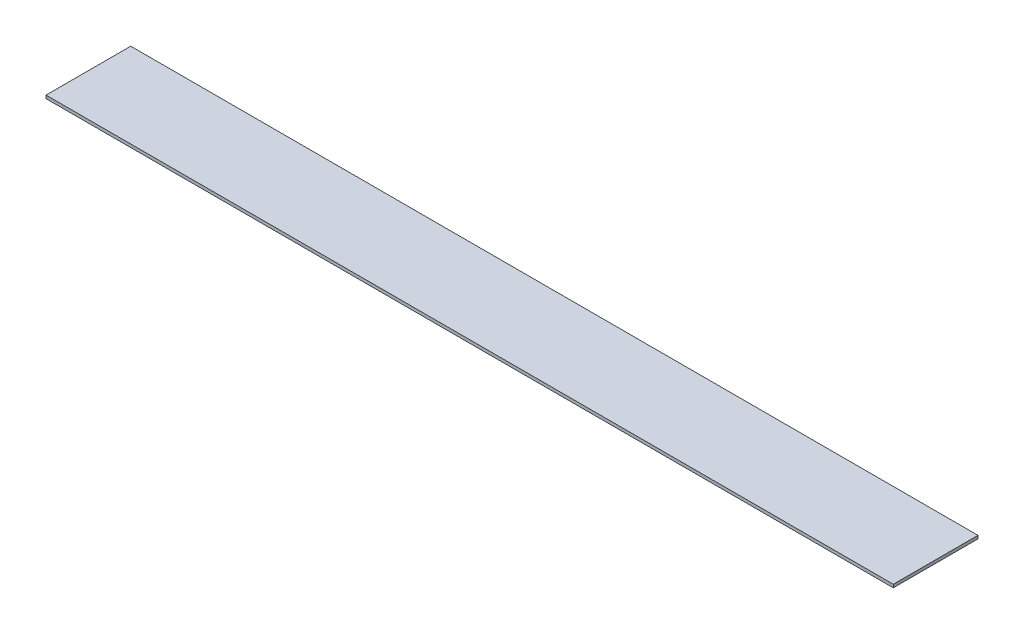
ISO-10303-21;
HEADER;
FILE_DESCRIPTION(('STEP AP214'),'2;1');
FILE_NAME('part.step','',(''),(''),'','','');
FILE_SCHEMA(('AUTOMOTIVE_DESIGN { 1 0 10303 214 1 1 1 1 }'));
ENDSEC;
DATA;
#1=APPLICATION_CONTEXT('core data for automotive mechanical design processes');
#2=APPLICATION_PROTOCOL_DEFINITION('international standard','automotive_design',2000,#1);
#3=PRODUCT_CONTEXT('',#1,'mechanical');
#4=PRODUCT('Part','Part','',(#3));
#5=PRODUCT_RELATED_PRODUCT_CATEGORY('part','',(#4));
#6=PRODUCT_DEFINITION_FORMATION('','',#4);
#7=PRODUCT_DEFINITION_CONTEXT('part definition',#1,'design');
#8=PRODUCT_DEFINITION('design','',#6,#7);
#9=PRODUCT_DEFINITION_SHAPE('','',#8);
#10=(LENGTH_UNIT() NAMED_UNIT(*) SI_UNIT(.MILLI.,.METRE.));
#11=(NAMED_UNIT(*) PLANE_ANGLE_UNIT() SI_UNIT($,.RADIAN.));
#12=(NAMED_UNIT(*) SI_UNIT($,.STERADIAN.) SOLID_ANGLE_UNIT());
#13=UNCERTAINTY_MEASURE_WITH_UNIT(LENGTH_MEASURE(1.E-05),#10,'distance_accuracy_value','');
#14=(GEOMETRIC_REPRESENTATION_CONTEXT(3) GLOBAL_UNCERTAINTY_ASSIGNED_CONTEXT((#13)) GLOBAL_UNIT_ASSIGNED_CONTEXT((#10,
#11,#12)) REPRESENTATION_CONTEXT('',''));
#15=CARTESIAN_POINT('',(0.,0.,0.));
#16=DIRECTION('',(0.,0.,1.));
#17=DIRECTION('',(1.,0.,0.));
#18=AXIS2_PLACEMENT_3D('',#15,#16,#17);
#19=CARTESIAN_POINT('',(275.,2.,27.5));
#20=DIRECTION('',(-1.,0.,0.));
#21=DIRECTION('',(0.,0.,1.));
#22=AXIS2_PLACEMENT_3D('',#19,#20,#21);
#23=PLANE('',#22);
#24=DIRECTION('',(0.,0.,-1.));
#25=VECTOR('',#24,1.);
#26=CARTESIAN_POINT('',(275.,0.,27.5));
#27=LINE('',#26,#25);
#28=CARTESIAN_POINT('',(275.,0.,27.5));
#29=VERTEX_POINT('',#28);
#30=CARTESIAN_POINT('',(275.,0.,-27.5));
#31=VERTEX_POINT('',#30);
#32=EDGE_CURVE('E96',#29,#31,#27,.T.);
#33=ORIENTED_EDGE('',*,*,#32,.T.);
#34=DIRECTION('',(0.,-1.,0.));
#35=VECTOR('',#34,1.);
#36=CARTESIAN_POINT('',(275.,2.,-27.5));
#37=LINE('',#36,#35);
#38=CARTESIAN_POINT('',(275.,2.,-27.5));
#39=VERTEX_POINT('',#38);
#40=EDGE_CURVE('E11',#39,#31,#37,.T.);
#41=ORIENTED_EDGE('',*,*,#40,.F.);
#42=DIRECTION('',(0.,0.,-1.));
#43=VECTOR('',#42,1.);
#44=CARTESIAN_POINT('',(275.,2.,27.5));
#45=LINE('',#44,#43);
#46=CARTESIAN_POINT('',(275.,2.,27.5));
#47=VERTEX_POINT('',#46);
#48=EDGE_CURVE('E84',#47,#39,#45,.T.);
#49=ORIENTED_EDGE('',*,*,#48,.F.);
#50=DIRECTION('',(0.,-1.,0.));
#51=VECTOR('',#50,1.);
#52=CARTESIAN_POINT('',(275.,2.,27.5));
#53=LINE('',#52,#51);
#54=EDGE_CURVE('E92',#47,#29,#53,.T.);
#55=ORIENTED_EDGE('',*,*,#54,.T.);
#56=EDGE_LOOP('',(#33,#41,#49,#55));
#57=FACE_BOUND('',#56,.T.);
#58=ADVANCED_FACE('F33',(#57),#23,.F.);
#59=CARTESIAN_POINT('',(275.,2.,-27.5));
#60=DIRECTION('',(0.,0.,1.));
#61=DIRECTION('',(1.,0.,0.));
#62=AXIS2_PLACEMENT_3D('',#59,#60,#61);
#63=PLANE('',#62);
#64=DIRECTION('',(-1.,0.,0.));
#65=VECTOR('',#64,1.);
#66=CARTESIAN_POINT('',(275.,0.,-27.5));
#67=LINE('',#66,#65);
#68=CARTESIAN_POINT('',(-275.,0.,-27.5));
#69=VERTEX_POINT('',#68);
#70=EDGE_CURVE('E88',#31,#69,#67,.T.);
#71=ORIENTED_EDGE('',*,*,#70,.T.);
#72=DIRECTION('',(0.,-1.,0.));
#73=VECTOR('',#72,1.);
#74=CARTESIAN_POINT('',(-275.,2.,-27.5));
#75=LINE('',#74,#73);
#76=CARTESIAN_POINT('',(-275.,2.,-27.5));
#77=VERTEX_POINT('',#76);
#78=EDGE_CURVE('E41',#77,#69,#75,.T.);
#79=ORIENTED_EDGE('',*,*,#78,.F.);
#80=DIRECTION('',(-1.,0.,0.));
#81=VECTOR('',#80,1.);
#82=CARTESIAN_POINT('',(275.,2.,-27.5));
#83=LINE('',#82,#81);
#84=EDGE_CURVE('E79',#39,#77,#83,.T.);
#85=ORIENTED_EDGE('',*,*,#84,.F.);
#86=ORIENTED_EDGE('',*,*,#40,.T.);
#87=EDGE_LOOP('',(#71,#79,#85,#86));
#88=FACE_BOUND('',#87,.T.);
#89=ADVANCED_FACE('F87',(#88),#63,.F.);
#90=CARTESIAN_POINT('',(-275.,2.,27.5));
#91=DIRECTION('',(1.,0.,0.));
#92=DIRECTION('',(0.,0.,-1.));
#93=AXIS2_PLACEMENT_3D('',#90,#91,#92);
#94=PLANE('',#93);
#95=DIRECTION('',(0.,0.,1.));
#96=VECTOR('',#95,1.);
#97=CARTESIAN_POINT('',(-275.,0.,27.5));
#98=LINE('',#97,#96);
#99=CARTESIAN_POINT('',(-275.,0.,27.5));
#100=VERTEX_POINT('',#99);
#101=EDGE_CURVE('E66',#69,#100,#98,.T.);
#102=ORIENTED_EDGE('',*,*,#101,.T.);
#103=DIRECTION('',(0.,-1.,0.));
#104=VECTOR('',#103,1.);
#105=CARTESIAN_POINT('',(-275.,2.,27.5));
#106=LINE('',#105,#104);
#107=CARTESIAN_POINT('',(-275.,2.,27.5));
#108=VERTEX_POINT('',#107);
#109=EDGE_CURVE('E89',#108,#100,#106,.T.);
#110=ORIENTED_EDGE('',*,*,#109,.F.);
#111=DIRECTION('',(0.,0.,1.));
#112=VECTOR('',#111,1.);
#113=CARTESIAN_POINT('',(-275.,2.,27.5));
#114=LINE('',#113,#112);
#115=EDGE_CURVE('E82',#77,#108,#114,.T.);
#116=ORIENTED_EDGE('',*,*,#115,.F.);
#117=ORIENTED_EDGE('',*,*,#78,.T.);
#118=EDGE_LOOP('',(#102,#110,#116,#117));
#119=FACE_BOUND('',#118,.T.);
#120=ADVANCED_FACE('F90',(#119),#94,.F.);
#121=CARTESIAN_POINT('',(275.,2.,27.5));
#122=DIRECTION('',(0.,0.,-1.));
#123=DIRECTION('',(-1.,0.,0.));
#124=AXIS2_PLACEMENT_3D('',#121,#122,#123);
#125=PLANE('',#124);
#126=DIRECTION('',(1.,0.,0.));
#127=VECTOR('',#126,1.);
#128=CARTESIAN_POINT('',(275.,0.,27.5));
#129=LINE('',#128,#127);
#130=EDGE_CURVE('E72',#100,#29,#129,.T.);
#131=ORIENTED_EDGE('',*,*,#130,.T.);
#132=ORIENTED_EDGE('',*,*,#54,.F.);
#133=DIRECTION('',(1.,0.,0.));
#134=VECTOR('',#133,1.);
#135=CARTESIAN_POINT('',(275.,2.,27.5));
#136=LINE('',#135,#134);
#137=EDGE_CURVE('E49',#108,#47,#136,.T.);
#138=ORIENTED_EDGE('',*,*,#137,.F.);
#139=ORIENTED_EDGE('',*,*,#109,.T.);
#140=EDGE_LOOP('',(#131,#132,#138,#139));
#141=FACE_BOUND('',#140,.T.);
#142=ADVANCED_FACE('F103',(#141),#125,.F.);
#143=CARTESIAN_POINT('',(275.,2.,-27.5));
#144=DIRECTION('',(0.,1.,0.));
#145=DIRECTION('',(0.,0.,1.));
#146=AXIS2_PLACEMENT_3D('',#143,#144,#145);
#147=PLANE('',#146);
#148=ORIENTED_EDGE('',*,*,#48,.T.);
#149=ORIENTED_EDGE('',*,*,#84,.T.);
#150=ORIENTED_EDGE('',*,*,#115,.T.);
#151=ORIENTED_EDGE('',*,*,#137,.T.);
#152=EDGE_LOOP('',(#148,#149,#150,#151));
#153=FACE_BOUND('',#152,.T.);
#154=ADVANCED_FACE('F80',(#153),#147,.T.);
#155=CARTESIAN_POINT('',(275.,0.,-27.5));
#156=DIRECTION('',(0.,1.,0.));
#157=DIRECTION('',(0.,0.,1.));
#158=AXIS2_PLACEMENT_3D('',#155,#156,#157);
#159=PLANE('',#158);
#160=ORIENTED_EDGE('',*,*,#32,.F.);
#161=ORIENTED_EDGE('',*,*,#130,.F.);
#162=ORIENTED_EDGE('',*,*,#101,.F.);
#163=ORIENTED_EDGE('',*,*,#70,.F.);
#164=EDGE_LOOP('',(#160,#161,#162,#163));
#165=FACE_BOUND('',#164,.T.);
#166=ADVANCED_FACE('F106',(#165),#159,.F.);
#167=CLOSED_SHELL('',(#58,#89,#120,#142,#154,#166));
#168=MANIFOLD_SOLID_BREP('B2',#167);
#169=ADVANCED_BREP_SHAPE_REPRESENTATION('',(#18,#168),#14);
#170=SHAPE_DEFINITION_REPRESENTATION(#9,#169);
ENDSEC;
END-ISO-10303-21;
